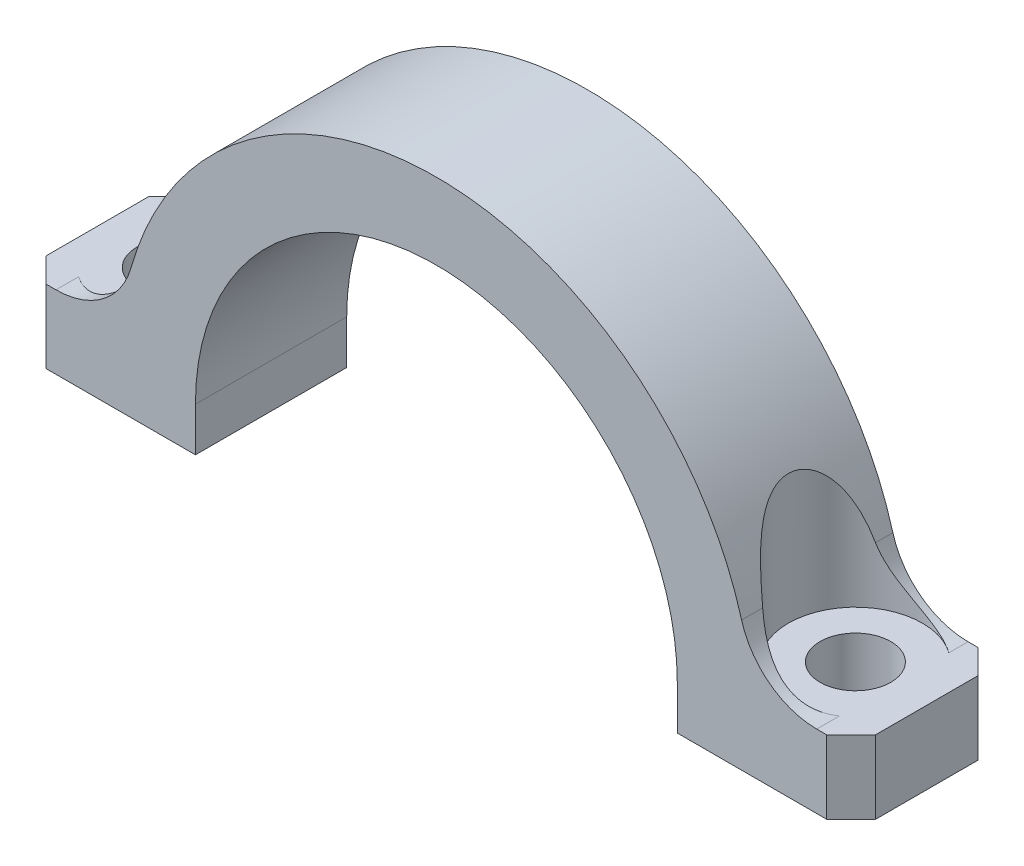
ISO-10303-21;
HEADER;
FILE_DESCRIPTION(('STEP AP214'),'2;1');
FILE_NAME('part.step','',(''),(''),'','','');
FILE_SCHEMA(('AUTOMOTIVE_DESIGN { 1 0 10303 214 1 1 1 1 }'));
ENDSEC;
DATA;
#1=APPLICATION_CONTEXT('core data for automotive mechanical design processes');
#2=APPLICATION_PROTOCOL_DEFINITION('international standard','automotive_design',2000,#1);
#3=PRODUCT_CONTEXT('',#1,'mechanical');
#4=PRODUCT('Part','Part','',(#3));
#5=PRODUCT_RELATED_PRODUCT_CATEGORY('part','',(#4));
#6=PRODUCT_DEFINITION_FORMATION('','',#4);
#7=PRODUCT_DEFINITION_CONTEXT('part definition',#1,'design');
#8=PRODUCT_DEFINITION('design','',#6,#7);
#9=PRODUCT_DEFINITION_SHAPE('','',#8);
#10=(LENGTH_UNIT() NAMED_UNIT(*) SI_UNIT(.MILLI.,.METRE.));
#11=(NAMED_UNIT(*) PLANE_ANGLE_UNIT() SI_UNIT($,.RADIAN.));
#12=(NAMED_UNIT(*) SI_UNIT($,.STERADIAN.) SOLID_ANGLE_UNIT());
#13=UNCERTAINTY_MEASURE_WITH_UNIT(LENGTH_MEASURE(1.E-05),#10,'distance_accuracy_value','');
#14=(GEOMETRIC_REPRESENTATION_CONTEXT(3) GLOBAL_UNCERTAINTY_ASSIGNED_CONTEXT((#13)) GLOBAL_UNIT_ASSIGNED_CONTEXT((#10,
#11,#12)) REPRESENTATION_CONTEXT('',''));
#15=CARTESIAN_POINT('',(0.,0.,0.));
#16=DIRECTION('',(0.,0.,1.));
#17=DIRECTION('',(1.,0.,0.));
#18=AXIS2_PLACEMENT_3D('',#15,#16,#17);
#19=CARTESIAN_POINT('',(28.,31.6,6.05));
#20=DIRECTION('',(0.,-1.,0.));
#21=DIRECTION('',(0.,0.,-1.));
#22=AXIS2_PLACEMENT_3D('',#19,#20,#21);
#23=CYLINDRICAL_SURFACE('',#22,5.5);
#24=CARTESIAN_POINT('',(25.0226295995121,12.6617283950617,10.674420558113));
#25=CARTESIAN_POINT('',(24.9809340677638,12.8094799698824,10.6475663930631));
#26=CARTESIAN_POINT('',(24.9379992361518,12.956602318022,10.6191342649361));
#27=CARTESIAN_POINT('',(24.8497396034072,13.2494318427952,10.558740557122));
#28=CARTESIAN_POINT('',(24.8044143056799,13.3951387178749,10.526778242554));
#29=CARTESIAN_POINT('',(24.7112978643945,13.6854862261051,10.4588287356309));
#30=CARTESIAN_POINT('',(24.6634977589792,13.8301204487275,10.4228262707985));
#31=CARTESIAN_POINT('',(24.5657416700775,14.1174759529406,10.3464759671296));
#32=CARTESIAN_POINT('',(24.5157858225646,14.2601973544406,10.3061284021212));
#33=CARTESIAN_POINT('',(24.3616637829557,14.6885620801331,10.1768314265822));
#34=CARTESIAN_POINT('',(24.254356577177,14.9709408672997,10.0804126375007));
#35=CARTESIAN_POINT('',(24.0888323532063,15.3852093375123,9.91764734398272));
#36=CARTESIAN_POINT('',(24.0329376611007,15.5216568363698,9.86041567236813));
#37=CARTESIAN_POINT('',(23.9199644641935,15.7910052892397,9.73919870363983));
#38=CARTESIAN_POINT('',(23.8628862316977,15.9239070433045,9.67521494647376));
#39=CARTESIAN_POINT('',(23.7560765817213,16.1671144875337,9.54927615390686));
#40=CARTESIAN_POINT('',(23.7064409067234,16.2779693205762,9.48830139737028));
#41=CARTESIAN_POINT('',(23.6069914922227,16.4960686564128,9.36029425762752));
#42=CARTESIAN_POINT('',(23.5571777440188,16.6033129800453,9.2932615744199));
#43=CARTESIAN_POINT('',(23.4578585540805,16.8134906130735,9.15263688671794));
#44=CARTESIAN_POINT('',(23.4083529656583,16.9164261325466,9.07904830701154));
#45=CARTESIAN_POINT('',(23.3101989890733,17.1172530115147,8.92474049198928));
#46=CARTESIAN_POINT('',(23.2615505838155,17.2151444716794,8.8440213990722));
#47=CARTESIAN_POINT('',(23.1651038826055,17.4063362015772,8.67364017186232));
#48=CARTESIAN_POINT('',(23.1173287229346,17.4995474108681,8.58386365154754));
#49=CARTESIAN_POINT('',(23.0243285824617,17.6785146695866,8.39600103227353));
#50=CARTESIAN_POINT('',(22.9791040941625,17.764269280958,8.29791333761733));
#51=CARTESIAN_POINT('',(22.8491521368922,18.0076448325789,7.9910750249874));
#52=CARTESIAN_POINT('',(22.7696690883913,18.152310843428,7.76895036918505));
#53=CARTESIAN_POINT('',(22.6622247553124,18.344834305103,7.38461369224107));
#54=CARTESIAN_POINT('',(22.6262281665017,18.4084909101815,7.2324775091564));
#55=CARTESIAN_POINT('',(22.5666158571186,18.5132284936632,6.91822476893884));
#56=CARTESIAN_POINT('',(22.5429912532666,18.5543256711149,6.75611546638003));
#57=CARTESIAN_POINT('',(22.5102696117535,18.6111068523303,6.42504264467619));
#58=CARTESIAN_POINT('',(22.5012548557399,18.6266469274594,6.25604576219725));
#59=CARTESIAN_POINT('',(22.498991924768,18.6305553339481,5.91763677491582));
#60=CARTESIAN_POINT('',(22.5057413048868,18.6189278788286,5.74822473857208));
#61=CARTESIAN_POINT('',(22.5331424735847,18.5714349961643,5.42760603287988));
#62=CARTESIAN_POINT('',(22.552678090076,18.537514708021,5.27600500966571));
#63=CARTESIAN_POINT('',(22.6028610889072,18.4496387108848,4.98071814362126));
#64=CARTESIAN_POINT('',(22.6335129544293,18.395674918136,4.83703552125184));
#65=CARTESIAN_POINT('',(22.717099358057,18.2468614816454,4.50734141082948));
#66=CARTESIAN_POINT('',(22.7740770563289,18.1442675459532,4.32586171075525));
#67=CARTESIAN_POINT('',(22.8994734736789,17.9138655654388,3.98409316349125));
#68=CARTESIAN_POINT('',(22.9679151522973,17.7860068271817,3.82384802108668));
#69=CARTESIAN_POINT('',(23.0940701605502,17.5447799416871,3.5604867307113));
#70=CARTESIAN_POINT('',(23.1503651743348,17.4354064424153,3.45293576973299));
#71=CARTESIAN_POINT('',(23.2652938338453,17.207856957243,3.24887863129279));
#72=CARTESIAN_POINT('',(23.3239287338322,17.0896762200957,3.15237848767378));
#73=CARTESIAN_POINT('',(23.4423806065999,16.846029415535,2.96941468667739));
#74=CARTESIAN_POINT('',(23.502199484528,16.7205508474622,2.88296905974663));
#75=CARTESIAN_POINT('',(23.6220027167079,16.4637518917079,2.71932261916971));
#76=CARTESIAN_POINT('',(23.6819871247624,16.3324293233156,2.64212529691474));
#77=CARTESIAN_POINT('',(23.8487775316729,15.9587954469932,2.43806375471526));
#78=CARTESIAN_POINT('',(23.9549469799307,15.7111426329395,2.32042681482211));
#79=CARTESIAN_POINT('',(24.1625251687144,15.2045585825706,2.10717104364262));
#80=CARTESIAN_POINT('',(24.2639295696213,14.945617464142,2.01157198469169));
#81=CARTESIAN_POINT('',(24.4601438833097,14.4193121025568,1.83852541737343));
#82=CARTESIAN_POINT('',(24.5549522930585,14.1519459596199,1.76108203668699));
#83=CARTESIAN_POINT('',(24.73674959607,13.6109078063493,1.62119254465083));
#84=CARTESIAN_POINT('',(24.823742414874,13.3372390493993,1.55873887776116));
#85=CARTESIAN_POINT('',(24.9263375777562,12.9947616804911,1.48895078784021));
#86=CARTESIAN_POINT('',(24.9459623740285,12.9282862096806,1.47579063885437));
#87=CARTESIAN_POINT('',(24.9846844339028,12.7951606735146,1.45017252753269));
#88=CARTESIAN_POINT('',(25.003782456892,12.7285110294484,1.43771352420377));
#89=CARTESIAN_POINT('',(25.0226295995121,12.6617283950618,1.4255794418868));
#90=B_SPLINE_CURVE_WITH_KNOTS('',3,(#24,#25,#26,#27,#28,#29,#30,#31,#32,#33,#34,#35,#36,#37,#38,
#39,#40,#41,#42,#43,#44,#45,#46,#47,#48,#49,#50,#51,#52,#53,#54,#55,#56,#57,#58,#59,#60,#61,#62,
#63,#64,#65,#66,#67,#68,#69,#70,#71,#72,#73,#74,#75,#76,#77,#78,#79,#80,#81,#82,#83,#84,#85,#86,
#87,#88,#89),.UNSPECIFIED.,.F.,.F.,(4,2,2,2,2,2,2,2,2,2,2,2,2,2,2,2,2,2,2,2,2,2,2,2,2,2,2,2,2,2,
2,2,4),(0.,0.467554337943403,0.93520619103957,1.40468951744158,1.87414327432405,
2.82419931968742,3.29856533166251,3.77282338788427,4.18038106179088,4.58795892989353,
4.99532511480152,5.40268316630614,5.81605208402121,6.22950054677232,7.05249297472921,
7.55702671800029,8.06119769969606,8.56819839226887,9.07512045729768,9.54281720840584,
10.0107027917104,10.6554643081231,11.3015329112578,11.7910696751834,12.2808724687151,
12.7715404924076,13.2623931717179,14.142948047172,15.0242899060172,15.9058319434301,
16.7869287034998,16.9985765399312,17.2099013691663),.UNSPECIFIED.);
#91=CARTESIAN_POINT('',(25.0226295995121,12.6617283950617,10.674420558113));
#92=VERTEX_POINT('',#91);
#93=CARTESIAN_POINT('',(25.0226295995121,12.6617283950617,1.42557944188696));
#94=VERTEX_POINT('',#93);
#95=EDGE_CURVE('E330',#92,#94,#90,.T.);
#96=ORIENTED_EDGE('',*,*,#95,.F.);
#97=CARTESIAN_POINT('',(25.0226295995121,12.6617283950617,10.674420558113));
#98=CARTESIAN_POINT('',(25.0721809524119,12.4861693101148,10.7063042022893));
#99=CARTESIAN_POINT('',(25.1290289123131,12.3134242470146,10.7418017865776));
#100=CARTESIAN_POINT('',(25.2567473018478,11.9743761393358,10.8176110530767));
#101=CARTESIAN_POINT('',(25.327610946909,11.8080700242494,10.8579204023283));
#102=CARTESIAN_POINT('',(25.4835636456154,11.4810228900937,10.9413626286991));
#103=CARTESIAN_POINT('',(25.5687793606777,11.3203483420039,10.9845183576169));
#104=CARTESIAN_POINT('',(25.7525601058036,11.0068152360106,11.0708889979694));
#105=CARTESIAN_POINT('',(25.8511264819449,10.853957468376,11.1141039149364));
#106=CARTESIAN_POINT('',(26.0613145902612,10.5566590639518,11.1982347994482));
#107=CARTESIAN_POINT('',(26.1729445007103,10.4122237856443,11.2391493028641));
#108=CARTESIAN_POINT('',(26.4088665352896,10.1326581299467,11.3162791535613));
#109=CARTESIAN_POINT('',(26.5331609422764,9.99752943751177,11.3524936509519));
#110=CARTESIAN_POINT('',(26.7930682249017,9.73841890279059,11.4176024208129));
#111=CARTESIAN_POINT('',(26.9286060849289,9.61437309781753,11.4465407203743));
#112=CARTESIAN_POINT('',(27.210797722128,9.37774739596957,11.4949620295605));
#113=CARTESIAN_POINT('',(27.3574405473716,9.26515645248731,11.5144542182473));
#114=CARTESIAN_POINT('',(27.5882533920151,9.10339410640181,11.5351438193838));
#115=CARTESIAN_POINT('',(27.6688436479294,9.04959712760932,11.540632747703));
#116=CARTESIAN_POINT('',(27.8325850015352,8.94559613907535,11.5480626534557));
#117=CARTESIAN_POINT('',(27.9157384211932,8.89539553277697,11.5500003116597));
#118=CARTESIAN_POINT('',(28.1085199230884,8.78492438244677,11.5499995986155));
#119=CARTESIAN_POINT('',(28.2188779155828,8.7259155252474,11.5467847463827));
#120=CARTESIAN_POINT('',(28.4425585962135,8.61460291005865,11.5333109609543));
#121=CARTESIAN_POINT('',(28.5558822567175,8.56230138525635,11.5230496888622));
#122=CARTESIAN_POINT('',(28.7846666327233,8.4646780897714,11.4949596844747));
#123=CARTESIAN_POINT('',(28.9001285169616,8.41936027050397,11.4771266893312));
#124=CARTESIAN_POINT('',(29.1321967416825,8.33589835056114,11.4335002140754));
#125=CARTESIAN_POINT('',(29.2488035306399,8.29775718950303,11.4077034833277));
#126=CARTESIAN_POINT('',(29.4822760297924,8.22864435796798,11.3478680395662));
#127=CARTESIAN_POINT('',(29.599141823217,8.19768593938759,11.313814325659));
#128=CARTESIAN_POINT('',(29.8317833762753,8.14291876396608,11.2374416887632));
#129=CARTESIAN_POINT('',(29.9475595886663,8.11910689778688,11.1951263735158));
#130=CARTESIAN_POINT('',(30.1769778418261,8.07833803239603,11.1023336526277));
#131=CARTESIAN_POINT('',(30.2906205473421,8.06137886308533,11.051858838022));
#132=CARTESIAN_POINT('',(30.5147917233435,8.03387726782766,10.9429889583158));
#133=CARTESIAN_POINT('',(30.6253214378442,8.02333224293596,10.884597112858));
#134=CARTESIAN_POINT('',(30.8108109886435,8.01030999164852,10.7783410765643));
#135=CARTESIAN_POINT('',(30.8867594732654,8.00637783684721,10.7323599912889));
#136=CARTESIAN_POINT('',(31.0362313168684,8.00122483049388,10.6368460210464));
#137=CARTESIAN_POINT('',(31.109760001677,7.99999756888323,10.587321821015));
#138=CARTESIAN_POINT('',(31.1820461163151,7.99999999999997,10.5360430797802));
#139=B_SPLINE_CURVE_WITH_KNOTS('',3,(#97,#98,#99,#100,#101,#102,#103,#104,#105,#106,#107,#108,
#109,#110,#111,#112,#113,#114,#115,#116,#117,#118,#119,#120,#121,#122,#123,#124,#125,#126,#127,
#128,#129,#130,#131,#132,#133,#134,#135,#136,#137,#138),.UNSPECIFIED.,.F.,.F.,(4,2,2,2,2,2,2,2,
2,2,2,2,2,2,2,2,2,2,2,2,4),(0.,0.555219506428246,1.11017090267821,1.67030459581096,
2.23049480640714,2.79103761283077,3.35168164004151,3.90884691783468,4.46546969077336,
4.75648424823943,5.04777066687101,5.42291649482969,5.79818690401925,6.17366886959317,
6.54930430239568,6.92562735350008,7.30178643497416,7.67782630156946,8.05371369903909,
8.32018625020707,8.58602663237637),.UNSPECIFIED.);
#140=CARTESIAN_POINT('',(31.1820461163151,7.99999999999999,10.5360430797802));
#141=VERTEX_POINT('',#140);
#142=EDGE_CURVE('E223',#92,#141,#139,.T.);
#143=ORIENTED_EDGE('',*,*,#142,.T.);
#144=CARTESIAN_POINT('',(28.,8.00000000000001,6.05));
#145=DIRECTION('',(0.,-1.,0.));
#146=DIRECTION('',(0.,0.,-1.));
#147=AXIS2_PLACEMENT_3D('',#144,#145,#146);
#148=CIRCLE('',#147,5.5);
#149=CARTESIAN_POINT('',(31.1820461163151,7.99999999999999,1.56395692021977));
#150=VERTEX_POINT('',#149);
#151=EDGE_CURVE('E241',#141,#150,#148,.T.);
#152=ORIENTED_EDGE('',*,*,#151,.T.);
#153=CARTESIAN_POINT('',(31.1820461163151,7.99999999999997,1.56395692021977));
#154=CARTESIAN_POINT('',(31.080036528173,7.99998542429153,1.49157324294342));
#155=CARTESIAN_POINT('',(30.9755126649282,8.00243852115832,1.42268875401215));
#156=CARTESIAN_POINT('',(30.7621814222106,8.01289780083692,1.29227706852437));
#157=CARTESIAN_POINT('',(30.6533722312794,8.02090635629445,1.23075302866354));
#158=CARTESIAN_POINT('',(30.4322868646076,8.04309707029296,1.11547480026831));
#159=CARTESIAN_POINT('',(30.3200101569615,8.05728018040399,1.06172181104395));
#160=CARTESIAN_POINT('',(30.0929713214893,8.09229821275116,0.962287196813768));
#161=CARTESIAN_POINT('',(29.9782097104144,8.1131317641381,0.916603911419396));
#162=CARTESIAN_POINT('',(29.7468437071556,8.16187425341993,0.833324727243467));
#163=CARTESIAN_POINT('',(29.6302347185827,8.18980484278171,0.795754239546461));
#164=CARTESIAN_POINT('',(29.3966027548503,8.25290052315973,0.728885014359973));
#165=CARTESIAN_POINT('',(29.2795797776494,8.28806564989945,0.699586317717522));
#166=CARTESIAN_POINT('',(29.0464575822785,8.36557222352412,0.649155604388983));
#167=CARTESIAN_POINT('',(28.930356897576,8.4078977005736,0.628005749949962));
#168=CARTESIAN_POINT('',(28.6998730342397,8.49964470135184,0.593467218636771));
#169=CARTESIAN_POINT('',(28.5854891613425,8.5490632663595,0.580075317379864));
#170=CARTESIAN_POINT('',(28.3921722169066,8.63940494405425,0.563407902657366));
#171=CARTESIAN_POINT('',(28.3125896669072,8.67862808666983,0.55832401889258));
#172=CARTESIAN_POINT('',(28.1550349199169,8.76040059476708,0.55162014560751));
#173=CARTESIAN_POINT('',(28.0770623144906,8.80294910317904,0.549999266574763));
#174=CARTESIAN_POINT('',(27.8593562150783,8.92770776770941,0.550001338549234));
#175=CARTESIAN_POINT('',(27.7217444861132,9.0136771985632,0.555404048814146));
#176=CARTESIAN_POINT('',(27.4538447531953,9.1955048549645,0.575532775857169));
#177=CARTESIAN_POINT('',(27.3235629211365,9.2913712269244,0.590266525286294));
#178=CARTESIAN_POINT('',(27.0708883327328,9.49240079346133,0.627536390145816));
#179=CARTESIAN_POINT('',(26.9485228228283,9.59759341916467,0.650097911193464));
#180=CARTESIAN_POINT('',(26.7127157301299,9.81622855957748,0.701404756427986));
#181=CARTESIAN_POINT('',(26.5992785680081,9.92967510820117,0.730153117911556));
#182=CARTESIAN_POINT('',(26.3828132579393,10.1629676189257,0.791934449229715));
#183=CARTESIAN_POINT('',(26.2796978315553,10.2827439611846,0.82492491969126));
#184=CARTESIAN_POINT('',(26.0830010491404,10.5290064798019,0.893840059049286));
#185=CARTESIAN_POINT('',(25.9894189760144,10.6554921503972,0.929764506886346));
#186=CARTESIAN_POINT('',(25.7236176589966,11.0438454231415,1.03953870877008));
#187=CARTESIAN_POINT('',(25.5657847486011,11.3152138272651,1.1155637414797));
#188=CARTESIAN_POINT('',(25.3455162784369,11.767358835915,1.23205842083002));
#189=CARTESIAN_POINT('',(25.2700659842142,11.9414050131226,1.27467616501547));
#190=CARTESIAN_POINT('',(25.1346307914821,12.2964835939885,1.35470707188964));
#191=CARTESIAN_POINT('',(25.0746408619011,12.4775137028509,1.3921219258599));
#192=CARTESIAN_POINT('',(25.0226295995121,12.6617283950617,1.42557944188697));
#193=B_SPLINE_CURVE_WITH_KNOTS('',3,(#153,#154,#155,#156,#157,#158,#159,#160,#161,#162,#163,
#164,#165,#166,#167,#168,#169,#170,#171,#172,#173,#174,#175,#176,#177,#178,#179,#180,#181,#182,
#183,#184,#185,#186,#187,#188,#189,#190,#191,#192),.UNSPECIFIED.,.F.,.F.,(4,2,2,2,2,2,2,2,2,2,2,
2,2,2,2,2,2,2,2,4),(0.,0.375185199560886,0.750530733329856,1.12593413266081,1.50126020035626,
1.87774534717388,2.25423235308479,2.62989048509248,3.00539237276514,3.27185826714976,
3.53825570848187,4.02444853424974,4.51104479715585,4.99923535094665,5.4876661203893,
5.97153765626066,6.45537276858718,7.42054162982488,8.00311680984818,8.58550216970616),.UNSPECIFIED.);
#194=EDGE_CURVE('E361',#150,#94,#193,.T.);
#195=ORIENTED_EDGE('',*,*,#194,.T.);
#196=EDGE_LOOP('',(#96,#143,#152,#195));
#197=FACE_BOUND('',#196,.T.);
#198=ADVANCED_FACE('F17',(#197),#23,.F.);
#199=CARTESIAN_POINT('',(-28.,31.6,6.05));
#200=DIRECTION('',(0.,-1.,0.));
#201=DIRECTION('',(0.,0.,-1.));
#202=AXIS2_PLACEMENT_3D('',#199,#200,#201);
#203=CYLINDRICAL_SURFACE('',#202,5.5);
#204=CARTESIAN_POINT('',(-31.1820461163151,7.99999999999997,10.5360430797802));
#205=CARTESIAN_POINT('',(-31.080036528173,7.99998542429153,10.6084267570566));
#206=CARTESIAN_POINT('',(-30.9755126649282,8.00243852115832,10.6773112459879));
#207=CARTESIAN_POINT('',(-30.7621814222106,8.01289780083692,10.8077229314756));
#208=CARTESIAN_POINT('',(-30.6533722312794,8.02090635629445,10.8692469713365));
#209=CARTESIAN_POINT('',(-30.4322868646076,8.04309707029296,10.9845251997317));
#210=CARTESIAN_POINT('',(-30.3200101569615,8.05728018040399,11.0382781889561));
#211=CARTESIAN_POINT('',(-30.0929713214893,8.09229821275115,11.1377128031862));
#212=CARTESIAN_POINT('',(-29.9782097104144,8.1131317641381,11.1833960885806));
#213=CARTESIAN_POINT('',(-29.7468437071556,8.16187425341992,11.2666752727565));
#214=CARTESIAN_POINT('',(-29.6302347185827,8.1898048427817,11.3042457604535));
#215=CARTESIAN_POINT('',(-29.3966027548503,8.25290052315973,11.37111498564));
#216=CARTESIAN_POINT('',(-29.2795797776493,8.28806564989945,11.4004136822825));
#217=CARTESIAN_POINT('',(-29.0464575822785,8.36557222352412,11.450844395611));
#218=CARTESIAN_POINT('',(-28.930356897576,8.4078977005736,11.47199425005));
#219=CARTESIAN_POINT('',(-28.6998730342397,8.49964470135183,11.5065327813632));
#220=CARTESIAN_POINT('',(-28.5854891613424,8.5490632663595,11.5199246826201));
#221=CARTESIAN_POINT('',(-28.3921722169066,8.63940494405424,11.5365920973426));
#222=CARTESIAN_POINT('',(-28.3125896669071,8.67862808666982,11.5416759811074));
#223=CARTESIAN_POINT('',(-28.1550349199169,8.76040059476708,11.5483798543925));
#224=CARTESIAN_POINT('',(-28.0770623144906,8.80294910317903,11.5500007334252));
#225=CARTESIAN_POINT('',(-27.8593562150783,8.9277077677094,11.5499986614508));
#226=CARTESIAN_POINT('',(-27.7217444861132,9.01367719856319,11.5445959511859));
#227=CARTESIAN_POINT('',(-27.4538447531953,9.19550485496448,11.5244672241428));
#228=CARTESIAN_POINT('',(-27.3235629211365,9.29137122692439,11.5097334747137));
#229=CARTESIAN_POINT('',(-27.0708883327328,9.49240079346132,11.4724636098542));
#230=CARTESIAN_POINT('',(-26.9485228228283,9.59759341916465,11.4499020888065));
#231=CARTESIAN_POINT('',(-26.7127157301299,9.81622855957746,11.398595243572));
#232=CARTESIAN_POINT('',(-26.5992785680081,9.92967510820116,11.3698468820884));
#233=CARTESIAN_POINT('',(-26.3828132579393,10.1629676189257,11.3080655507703));
#234=CARTESIAN_POINT('',(-26.2796978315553,10.2827439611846,11.2750750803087));
#235=CARTESIAN_POINT('',(-26.0830010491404,10.5290064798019,11.2061599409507));
#236=CARTESIAN_POINT('',(-25.9894189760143,10.6554921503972,11.1702354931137));
#237=CARTESIAN_POINT('',(-25.7236176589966,11.0438454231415,11.0604612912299));
#238=CARTESIAN_POINT('',(-25.5657847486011,11.3152138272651,10.9844362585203));
#239=CARTESIAN_POINT('',(-25.3455162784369,11.767358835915,10.86794157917));
#240=CARTESIAN_POINT('',(-25.2700659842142,11.9414050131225,10.8253238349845));
#241=CARTESIAN_POINT('',(-25.1346307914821,12.2964835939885,10.7452929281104));
#242=CARTESIAN_POINT('',(-25.0746408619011,12.4775137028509,10.7078780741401));
#243=CARTESIAN_POINT('',(-25.0226295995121,12.6617283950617,10.674420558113));
#244=B_SPLINE_CURVE_WITH_KNOTS('',3,(#204,#205,#206,#207,#208,#209,#210,#211,#212,#213,#214,
#215,#216,#217,#218,#219,#220,#221,#222,#223,#224,#225,#226,#227,#228,#229,#230,#231,#232,#233,
#234,#235,#236,#237,#238,#239,#240,#241,#242,#243),.UNSPECIFIED.,.F.,.F.,(4,2,2,2,2,2,2,2,2,2,2,
2,2,2,2,2,2,2,2,4),(0.,0.375185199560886,0.75053073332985,1.12593413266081,1.50126020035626,
1.87774534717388,2.25423235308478,2.62989048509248,3.00539237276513,3.27185826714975,
3.53825570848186,4.02444853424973,4.51104479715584,4.99923535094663,5.48766612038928,
5.97153765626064,6.45537276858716,7.42054162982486,8.00311680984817,8.58550216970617),.UNSPECIFIED.);
#245=CARTESIAN_POINT('',(-31.1820461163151,7.99999999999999,10.5360430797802));
#246=VERTEX_POINT('',#245);
#247=CARTESIAN_POINT('',(-25.0226295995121,12.6617283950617,10.674420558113));
#248=VERTEX_POINT('',#247);
#249=EDGE_CURVE('E103',#246,#248,#244,.T.);
#250=ORIENTED_EDGE('',*,*,#249,.T.);
#251=CARTESIAN_POINT('',(-25.0226295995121,12.6617283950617,1.42557944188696));
#252=CARTESIAN_POINT('',(-24.9809340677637,12.8094799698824,1.45243360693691));
#253=CARTESIAN_POINT('',(-24.9379992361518,12.956602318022,1.48086573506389));
#254=CARTESIAN_POINT('',(-24.8497396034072,13.2494318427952,1.541259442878));
#255=CARTESIAN_POINT('',(-24.8044143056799,13.3951387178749,1.57322175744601));
#256=CARTESIAN_POINT('',(-24.7112978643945,13.6854862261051,1.64117126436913));
#257=CARTESIAN_POINT('',(-24.6634977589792,13.8301204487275,1.67717372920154));
#258=CARTESIAN_POINT('',(-24.5657416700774,14.1174759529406,1.75352403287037));
#259=CARTESIAN_POINT('',(-24.5157858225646,14.2601973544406,1.7938715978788));
#260=CARTESIAN_POINT('',(-24.3616637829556,14.6885620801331,1.92316857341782));
#261=CARTESIAN_POINT('',(-24.2543565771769,14.9709408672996,2.01958736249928));
#262=CARTESIAN_POINT('',(-24.0888323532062,15.3852093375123,2.18235265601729));
#263=CARTESIAN_POINT('',(-24.0329376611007,15.5216568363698,2.23958432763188));
#264=CARTESIAN_POINT('',(-23.9199644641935,15.7910052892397,2.36080129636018));
#265=CARTESIAN_POINT('',(-23.8628862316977,15.9239070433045,2.42478505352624));
#266=CARTESIAN_POINT('',(-23.7560765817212,16.1671144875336,2.55072384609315));
#267=CARTESIAN_POINT('',(-23.7064409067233,16.2779693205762,2.61169860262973));
#268=CARTESIAN_POINT('',(-23.6069914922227,16.4960686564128,2.73970574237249));
#269=CARTESIAN_POINT('',(-23.5571777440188,16.6033129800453,2.80673842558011));
#270=CARTESIAN_POINT('',(-23.4578585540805,16.8134906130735,2.94736311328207));
#271=CARTESIAN_POINT('',(-23.4083529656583,16.9164261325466,3.02095169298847));
#272=CARTESIAN_POINT('',(-23.3101989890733,17.1172530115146,3.17525950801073));
#273=CARTESIAN_POINT('',(-23.2615505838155,17.2151444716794,3.2559786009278));
#274=CARTESIAN_POINT('',(-23.1651038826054,17.4063362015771,3.42635982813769));
#275=CARTESIAN_POINT('',(-23.1173287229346,17.4995474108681,3.51613634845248));
#276=CARTESIAN_POINT('',(-23.0243285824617,17.6785146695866,3.70399896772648));
#277=CARTESIAN_POINT('',(-22.9791040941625,17.764269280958,3.80208666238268));
#278=CARTESIAN_POINT('',(-22.8491521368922,18.0076448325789,4.10892497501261));
#279=CARTESIAN_POINT('',(-22.7696690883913,18.1523108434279,4.33104963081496));
#280=CARTESIAN_POINT('',(-22.6622247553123,18.344834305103,4.71538630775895));
#281=CARTESIAN_POINT('',(-22.6262281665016,18.4084909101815,4.86752249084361));
#282=CARTESIAN_POINT('',(-22.5666158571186,18.5132284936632,5.18177523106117));
#283=CARTESIAN_POINT('',(-22.5429912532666,18.5543256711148,5.34388453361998));
#284=CARTESIAN_POINT('',(-22.5102696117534,18.6111068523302,5.67495735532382));
#285=CARTESIAN_POINT('',(-22.5012548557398,18.6266469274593,5.84395423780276));
#286=CARTESIAN_POINT('',(-22.498991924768,18.6305553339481,6.18236322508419));
#287=CARTESIAN_POINT('',(-22.5057413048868,18.6189278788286,6.35177526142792));
#288=CARTESIAN_POINT('',(-22.5331424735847,18.5714349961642,6.67239396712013));
#289=CARTESIAN_POINT('',(-22.552678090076,18.5375147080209,6.82399499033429));
#290=CARTESIAN_POINT('',(-22.6028610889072,18.4496387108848,7.11928185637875));
#291=CARTESIAN_POINT('',(-22.6335129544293,18.3956749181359,7.26296447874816));
#292=CARTESIAN_POINT('',(-22.717099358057,18.2468614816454,7.59265858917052));
#293=CARTESIAN_POINT('',(-22.7740770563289,18.1442675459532,7.77413828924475));
#294=CARTESIAN_POINT('',(-22.8994734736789,17.9138655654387,8.11590683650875));
#295=CARTESIAN_POINT('',(-22.9679151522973,17.7860068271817,8.27615197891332));
#296=CARTESIAN_POINT('',(-23.0940701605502,17.5447799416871,8.5395132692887));
#297=CARTESIAN_POINT('',(-23.1503651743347,17.4354064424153,8.64706423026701));
#298=CARTESIAN_POINT('',(-23.2652938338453,17.207856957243,8.85112136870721));
#299=CARTESIAN_POINT('',(-23.3239287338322,17.0896762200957,8.94762151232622));
#300=CARTESIAN_POINT('',(-23.4423806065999,16.846029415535,9.13058531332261));
#301=CARTESIAN_POINT('',(-23.502199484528,16.7205508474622,9.21703094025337));
#302=CARTESIAN_POINT('',(-23.6220027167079,16.4637518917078,9.3806773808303));
#303=CARTESIAN_POINT('',(-23.6819871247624,16.3324293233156,9.45787470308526));
#304=CARTESIAN_POINT('',(-23.8487775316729,15.9587954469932,9.66193624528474));
#305=CARTESIAN_POINT('',(-23.9549469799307,15.7111426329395,9.77957318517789));
#306=CARTESIAN_POINT('',(-24.1625251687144,15.2045585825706,9.99282895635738));
#307=CARTESIAN_POINT('',(-24.2639295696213,14.945617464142,10.0884280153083));
#308=CARTESIAN_POINT('',(-24.4601438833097,14.4193121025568,10.2614745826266));
#309=CARTESIAN_POINT('',(-24.5549522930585,14.1519459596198,10.338917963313));
#310=CARTESIAN_POINT('',(-24.73674959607,13.6109078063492,10.4788074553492));
#311=CARTESIAN_POINT('',(-24.823742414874,13.3372390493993,10.5412611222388));
#312=CARTESIAN_POINT('',(-24.9263375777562,12.9947616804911,10.6110492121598));
#313=CARTESIAN_POINT('',(-24.9459623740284,12.9282862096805,10.6242093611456));
#314=CARTESIAN_POINT('',(-24.9846844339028,12.7951606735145,10.6498274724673));
#315=CARTESIAN_POINT('',(-25.003782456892,12.7285110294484,10.6622864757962));
#316=CARTESIAN_POINT('',(-25.0226295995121,12.6617283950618,10.6744205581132));
#317=B_SPLINE_CURVE_WITH_KNOTS('',3,(#251,#252,#253,#254,#255,#256,#257,#258,#259,#260,#261,
#262,#263,#264,#265,#266,#267,#268,#269,#270,#271,#272,#273,#274,#275,#276,#277,#278,#279,#280,
#281,#282,#283,#284,#285,#286,#287,#288,#289,#290,#291,#292,#293,#294,#295,#296,#297,#298,#299,
#300,#301,#302,#303,#304,#305,#306,#307,#308,#309,#310,#311,#312,#313,#314,#315,#316),
.UNSPECIFIED.,.F.,.F.,(4,2,2,2,2,2,2,2,2,2,2,2,2,2,2,2,2,2,2,2,2,2,2,2,2,2,2,2,2,2,2,2,4),(0.,
0.4675543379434,0.935206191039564,1.40468951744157,1.87414327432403,2.82419931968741,
3.2985653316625,3.77282338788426,4.18038106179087,4.58795892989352,4.9953251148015,
5.40268316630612,5.81605208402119,6.2295005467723,7.0524929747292,7.55702671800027,
8.06119769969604,8.56819839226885,9.07512045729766,9.54281720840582,10.0107027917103,
10.655464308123,11.3015329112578,11.7910696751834,12.2808724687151,12.7715404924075,
13.2623931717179,14.142948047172,15.0242899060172,15.9058319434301,16.7869287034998,
16.9985765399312,17.2099013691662),.UNSPECIFIED.);
#318=CARTESIAN_POINT('',(-25.0226295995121,12.6617283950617,1.42557944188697));
#319=VERTEX_POINT('',#318);
#320=EDGE_CURVE('E355',#319,#248,#317,.T.);
#321=ORIENTED_EDGE('',*,*,#320,.F.);
#322=CARTESIAN_POINT('',(-25.0226295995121,12.6617283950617,1.42557944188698));
#323=CARTESIAN_POINT('',(-25.0721809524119,12.4861693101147,1.39369579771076));
#324=CARTESIAN_POINT('',(-25.1290289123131,12.3134242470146,1.35819821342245));
#325=CARTESIAN_POINT('',(-25.2567473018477,11.9743761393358,1.28238894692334));
#326=CARTESIAN_POINT('',(-25.327610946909,11.8080700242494,1.24207959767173));
#327=CARTESIAN_POINT('',(-25.4835636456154,11.4810228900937,1.15863737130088));
#328=CARTESIAN_POINT('',(-25.5687793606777,11.3203483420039,1.1154816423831));
#329=CARTESIAN_POINT('',(-25.7525601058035,11.0068152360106,1.02911100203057));
#330=CARTESIAN_POINT('',(-25.8511264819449,10.853957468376,0.985896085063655));
#331=CARTESIAN_POINT('',(-26.0613145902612,10.5566590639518,0.901765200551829));
#332=CARTESIAN_POINT('',(-26.1729445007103,10.4122237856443,0.860850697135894));
#333=CARTESIAN_POINT('',(-26.4088665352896,10.1326581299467,0.783720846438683));
#334=CARTESIAN_POINT('',(-26.5331609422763,9.99752943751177,0.747506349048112));
#335=CARTESIAN_POINT('',(-26.7930682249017,9.73841890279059,0.68239757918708));
#336=CARTESIAN_POINT('',(-26.9286060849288,9.61437309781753,0.653459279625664));
#337=CARTESIAN_POINT('',(-27.2107977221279,9.37774739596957,0.60503797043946));
#338=CARTESIAN_POINT('',(-27.3574405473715,9.26515645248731,0.585545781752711));
#339=CARTESIAN_POINT('',(-27.5882533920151,9.10339410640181,0.564856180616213));
#340=CARTESIAN_POINT('',(-27.6688436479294,9.04959712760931,0.559367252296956));
#341=CARTESIAN_POINT('',(-27.8325850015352,8.94559613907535,0.551937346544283));
#342=CARTESIAN_POINT('',(-27.9157384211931,8.89539553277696,0.549999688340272));
#343=CARTESIAN_POINT('',(-28.1085199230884,8.78492438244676,0.550000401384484));
#344=CARTESIAN_POINT('',(-28.2188779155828,8.72591552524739,0.553215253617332));
#345=CARTESIAN_POINT('',(-28.4425585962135,8.61460291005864,0.566689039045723));
#346=CARTESIAN_POINT('',(-28.5558822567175,8.56230138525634,0.576950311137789));
#347=CARTESIAN_POINT('',(-28.7846666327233,8.46467808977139,0.605040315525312));
#348=CARTESIAN_POINT('',(-28.9001285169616,8.41936027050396,0.622873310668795));
#349=CARTESIAN_POINT('',(-29.1321967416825,8.33589835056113,0.666499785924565));
#350=CARTESIAN_POINT('',(-29.2488035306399,8.29775718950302,0.692296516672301));
#351=CARTESIAN_POINT('',(-29.4822760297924,8.22864435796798,0.752131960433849));
#352=CARTESIAN_POINT('',(-29.599141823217,8.19768593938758,0.78618567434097));
#353=CARTESIAN_POINT('',(-29.8317833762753,8.14291876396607,0.862558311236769));
#354=CARTESIAN_POINT('',(-29.9475595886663,8.11910689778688,0.904873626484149));
#355=CARTESIAN_POINT('',(-30.1769778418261,8.07833803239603,0.997666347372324));
#356=CARTESIAN_POINT('',(-30.290620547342,8.06137886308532,1.048141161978));
#357=CARTESIAN_POINT('',(-30.5147917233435,8.03387726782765,1.15701104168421));
#358=CARTESIAN_POINT('',(-30.6253214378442,8.02333224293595,1.21540288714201));
#359=CARTESIAN_POINT('',(-30.8108109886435,8.01030999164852,1.32165892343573));
#360=CARTESIAN_POINT('',(-30.8867594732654,8.0063778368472,1.3676400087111));
#361=CARTESIAN_POINT('',(-31.0362313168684,8.00122483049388,1.46315397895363));
#362=CARTESIAN_POINT('',(-31.109760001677,7.99999756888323,1.512678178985));
#363=CARTESIAN_POINT('',(-31.1820461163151,7.99999999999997,1.56395692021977));
#364=B_SPLINE_CURVE_WITH_KNOTS('',3,(#322,#323,#324,#325,#326,#327,#328,#329,#330,#331,#332,
#333,#334,#335,#336,#337,#338,#339,#340,#341,#342,#343,#344,#345,#346,#347,#348,#349,#350,#351,
#352,#353,#354,#355,#356,#357,#358,#359,#360,#361,#362,#363),.UNSPECIFIED.,.F.,.F.,(4,2,2,2,2,2,
2,2,2,2,2,2,2,2,2,2,2,2,2,2,4),(0.,0.555219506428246,1.11017090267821,1.67030459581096,
2.23049480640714,2.79103761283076,3.35168164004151,3.90884691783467,4.46546969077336,
4.75648424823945,5.04777066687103,5.42291649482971,5.79818690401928,6.17366886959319,
6.5493043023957,6.9256273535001,7.30178643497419,7.67782630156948,8.05371369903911,
8.32018625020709,8.58602663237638),.UNSPECIFIED.);
#365=CARTESIAN_POINT('',(-31.1820461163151,7.99999999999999,1.56395692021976));
#366=VERTEX_POINT('',#365);
#367=EDGE_CURVE('E259',#319,#366,#364,.T.);
#368=ORIENTED_EDGE('',*,*,#367,.T.);
#369=CARTESIAN_POINT('',(-28.,8.00000000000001,6.05));
#370=DIRECTION('',(0.,-1.,0.));
#371=DIRECTION('',(0.,0.,-1.));
#372=AXIS2_PLACEMENT_3D('',#369,#370,#371);
#373=CIRCLE('',#372,5.5);
#374=EDGE_CURVE('E21',#366,#246,#373,.T.);
#375=ORIENTED_EDGE('',*,*,#374,.T.);
#376=EDGE_LOOP('',(#250,#321,#368,#375));
#377=FACE_BOUND('',#376,.T.);
#378=ADVANCED_FACE('F336',(#377),#203,.F.);
#379=CARTESIAN_POINT('',(-34.,8.00000000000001,12.4));
#380=DIRECTION('',(0.,-1.,0.));
#381=DIRECTION('',(1.,0.,0.));
#382=AXIS2_PLACEMENT_3D('',#379,#380,#381);
#383=PLANE('',#382);
#384=ORIENTED_EDGE('',*,*,#374,.F.);
#385=DIRECTION('',(0.,0.,-1.));
#386=VECTOR('',#385,1.);
#387=CARTESIAN_POINT('',(-31.1820461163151,7.99999999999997,12.4));
#388=LINE('',#387,#386);
#389=CARTESIAN_POINT('',(-31.1820461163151,7.99999999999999,0.));
#390=VERTEX_POINT('',#389);
#391=EDGE_CURVE('E504',#366,#390,#388,.T.);
#392=ORIENTED_EDGE('',*,*,#391,.T.);
#393=DIRECTION('',(1.,0.,0.));
#394=VECTOR('',#393,1.);
#395=CARTESIAN_POINT('',(-34.,8.00000000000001,0.));
#396=LINE('',#395,#394);
#397=CARTESIAN_POINT('',(-32.,8.00000000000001,0.));
#398=VERTEX_POINT('',#397);
#399=EDGE_CURVE('E123',#398,#390,#396,.T.);
#400=ORIENTED_EDGE('',*,*,#399,.F.);
#401=DIRECTION('',(0.707106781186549,0.,-0.707106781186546));
#402=VECTOR('',#401,1.);
#403=CARTESIAN_POINT('',(-34.,8.00000000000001,2.));
#404=LINE('',#403,#402);
#405=CARTESIAN_POINT('',(-34.,8.00000000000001,2.00000000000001));
#406=VERTEX_POINT('',#405);
#407=EDGE_CURVE('E258',#398,#406,#404,.F.);
#408=ORIENTED_EDGE('',*,*,#407,.T.);
#409=DIRECTION('',(0.,0.,-1.));
#410=VECTOR('',#409,1.);
#411=CARTESIAN_POINT('',(-34.,8.00000000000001,12.4));
#412=LINE('',#411,#410);
#413=CARTESIAN_POINT('',(-34.,8.00000000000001,10.4));
#414=VERTEX_POINT('',#413);
#415=EDGE_CURVE('E198',#406,#414,#412,.F.);
#416=ORIENTED_EDGE('',*,*,#415,.T.);
#417=DIRECTION('',(0.707106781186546,0.,0.707106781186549));
#418=VECTOR('',#417,1.);
#419=CARTESIAN_POINT('',(-32.,8.00000000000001,12.4));
#420=LINE('',#419,#418);
#421=CARTESIAN_POINT('',(-32.,8.00000000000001,12.4));
#422=VERTEX_POINT('',#421);
#423=EDGE_CURVE('E111',#422,#414,#420,.F.);
#424=ORIENTED_EDGE('',*,*,#423,.F.);
#425=DIRECTION('',(1.,0.,0.));
#426=VECTOR('',#425,1.);
#427=CARTESIAN_POINT('',(-34.,8.00000000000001,12.4));
#428=LINE('',#427,#426);
#429=CARTESIAN_POINT('',(-31.1820461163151,7.99999999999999,12.4));
#430=VERTEX_POINT('',#429);
#431=EDGE_CURVE('E187',#430,#422,#428,.F.);
#432=ORIENTED_EDGE('',*,*,#431,.F.);
#433=DIRECTION('',(0.,0.,-1.));
#434=VECTOR('',#433,1.);
#435=CARTESIAN_POINT('',(-31.1820461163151,7.99999999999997,12.4));
#436=LINE('',#435,#434);
#437=EDGE_CURVE('E218',#430,#246,#436,.T.);
#438=ORIENTED_EDGE('',*,*,#437,.T.);
#439=EDGE_LOOP('',(#384,#392,#400,#408,#416,#424,#432,#438));
#440=FACE_BOUND('',#439,.T.);
#441=CARTESIAN_POINT('',(-28.,8.00000000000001,6.05));
#442=DIRECTION('',(0.,1.,0.));
#443=DIRECTION('',(0.,0.,1.));
#444=AXIS2_PLACEMENT_3D('',#441,#442,#443);
#445=CIRCLE('',#444,2.9);
#446=CARTESIAN_POINT('',(-28.,8.00000000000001,8.95));
#447=VERTEX_POINT('',#446);
#448=EDGE_CURVE('E267',#447,#447,#445,.F.);
#449=ORIENTED_EDGE('',*,*,#448,.T.);
#450=EDGE_LOOP('',(#449));
#451=FACE_BOUND('',#450,.T.);
#452=ADVANCED_FACE('F196',(#440,#451),#383,.F.);
#453=CARTESIAN_POINT('',(-28.,8.00000000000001,6.05));
#454=DIRECTION('',(0.,1.,0.));
#455=DIRECTION('',(0.,0.,1.));
#456=AXIS2_PLACEMENT_3D('',#453,#454,#455);
#457=CYLINDRICAL_SURFACE('',#456,2.9);
#458=CARTESIAN_POINT('',(-28.,2.,6.05));
#459=DIRECTION('',(0.,1.,0.));
#460=DIRECTION('',(0.,0.,1.));
#461=AXIS2_PLACEMENT_3D('',#458,#459,#460);
#462=CIRCLE('',#461,2.9);
#463=CARTESIAN_POINT('',(-28.,2.,8.95));
#464=VERTEX_POINT('',#463);
#465=EDGE_CURVE('E320',#464,#464,#462,.F.);
#466=ORIENTED_EDGE('',*,*,#465,.T.);
#467=EDGE_LOOP('',(#466));
#468=FACE_BOUND('',#467,.T.);
#469=ORIENTED_EDGE('',*,*,#448,.F.);
#470=EDGE_LOOP('',(#469));
#471=FACE_BOUND('',#470,.T.);
#472=ADVANCED_FACE('F402',(#468,#471),#457,.F.);
#473=CARTESIAN_POINT('',(-34.,2.,12.4));
#474=DIRECTION('',(1.,0.,0.));
#475=DIRECTION('',(0.,0.,-1.));
#476=AXIS2_PLACEMENT_3D('',#473,#474,#475);
#477=PLANE('',#476);
#478=DIRECTION('',(0.,1.,0.));
#479=VECTOR('',#478,1.);
#480=CARTESIAN_POINT('',(-34.,5.60000000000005,10.4));
#481=LINE('',#480,#479);
#482=CARTESIAN_POINT('',(-34.,2.,10.4));
#483=VERTEX_POINT('',#482);
#484=EDGE_CURVE('E200',#414,#483,#481,.F.);
#485=ORIENTED_EDGE('',*,*,#484,.F.);
#486=ORIENTED_EDGE('',*,*,#415,.F.);
#487=DIRECTION('',(0.,1.,0.));
#488=VECTOR('',#487,1.);
#489=CARTESIAN_POINT('',(-34.,2.,2.00000000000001));
#490=LINE('',#489,#488);
#491=CARTESIAN_POINT('',(-34.,2.,2.00000000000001));
#492=VERTEX_POINT('',#491);
#493=EDGE_CURVE('E256',#406,#492,#490,.F.);
#494=ORIENTED_EDGE('',*,*,#493,.T.);
#495=DIRECTION('',(0.,0.,1.));
#496=VECTOR('',#495,1.);
#497=CARTESIAN_POINT('',(-34.,2.,12.4));
#498=LINE('',#497,#496);
#499=EDGE_CURVE('E251',#492,#483,#498,.T.);
#500=ORIENTED_EDGE('',*,*,#499,.T.);
#501=EDGE_LOOP('',(#485,#486,#494,#500));
#502=FACE_BOUND('',#501,.T.);
#503=ADVANCED_FACE('F398',(#502),#477,.F.);
#504=CARTESIAN_POINT('',(28.,8.00000000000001,6.05));
#505=DIRECTION('',(0.,1.,0.));
#506=DIRECTION('',(0.,0.,1.));
#507=AXIS2_PLACEMENT_3D('',#504,#505,#506);
#508=CYLINDRICAL_SURFACE('',#507,2.9);
#509=CARTESIAN_POINT('',(28.,2.,6.05));
#510=DIRECTION('',(0.,1.,0.));
#511=DIRECTION('',(0.,0.,1.));
#512=AXIS2_PLACEMENT_3D('',#509,#510,#511);
#513=CIRCLE('',#512,2.9);
#514=CARTESIAN_POINT('',(28.,2.,8.95));
#515=VERTEX_POINT('',#514);
#516=EDGE_CURVE('E228',#515,#515,#513,.F.);
#517=ORIENTED_EDGE('',*,*,#516,.T.);
#518=EDGE_LOOP('',(#517));
#519=FACE_BOUND('',#518,.T.);
#520=CARTESIAN_POINT('',(28.,8.00000000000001,6.05));
#521=DIRECTION('',(0.,1.,0.));
#522=DIRECTION('',(0.,0.,1.));
#523=AXIS2_PLACEMENT_3D('',#520,#521,#522);
#524=CIRCLE('',#523,2.9);
#525=CARTESIAN_POINT('',(28.,8.00000000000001,8.95));
#526=VERTEX_POINT('',#525);
#527=EDGE_CURVE('E266',#526,#526,#524,.T.);
#528=ORIENTED_EDGE('',*,*,#527,.T.);
#529=EDGE_LOOP('',(#528));
#530=FACE_BOUND('',#529,.T.);
#531=ADVANCED_FACE('F394',(#519,#530),#508,.F.);
#532=CARTESIAN_POINT('',(34.,2.,12.4));
#533=DIRECTION('',(-1.,0.,0.));
#534=DIRECTION('',(0.,0.,1.));
#535=AXIS2_PLACEMENT_3D('',#532,#533,#534);
#536=PLANE('',#535);
#537=DIRECTION('',(0.,1.,0.));
#538=VECTOR('',#537,1.);
#539=CARTESIAN_POINT('',(34.,5.60000000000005,10.4));
#540=LINE('',#539,#538);
#541=CARTESIAN_POINT('',(34.,2.,10.4));
#542=VERTEX_POINT('',#541);
#543=CARTESIAN_POINT('',(34.,8.00000000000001,10.4));
#544=VERTEX_POINT('',#543);
#545=EDGE_CURVE('E238',#542,#544,#540,.T.);
#546=ORIENTED_EDGE('',*,*,#545,.F.);
#547=DIRECTION('',(0.,0.,1.));
#548=VECTOR('',#547,1.);
#549=CARTESIAN_POINT('',(34.,2.,12.4));
#550=LINE('',#549,#548);
#551=CARTESIAN_POINT('',(34.,2.,2.00000000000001));
#552=VERTEX_POINT('',#551);
#553=EDGE_CURVE('E227',#542,#552,#550,.F.);
#554=ORIENTED_EDGE('',*,*,#553,.T.);
#555=DIRECTION('',(0.,1.,0.));
#556=VECTOR('',#555,1.);
#557=CARTESIAN_POINT('',(34.,2.,2.00000000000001));
#558=LINE('',#557,#556);
#559=CARTESIAN_POINT('',(34.,8.00000000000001,2.00000000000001));
#560=VERTEX_POINT('',#559);
#561=EDGE_CURVE('E167',#552,#560,#558,.T.);
#562=ORIENTED_EDGE('',*,*,#561,.T.);
#563=DIRECTION('',(0.,0.,-1.));
#564=VECTOR('',#563,1.);
#565=CARTESIAN_POINT('',(34.,8.00000000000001,12.4));
#566=LINE('',#565,#564);
#567=EDGE_CURVE('E159',#560,#544,#566,.F.);
#568=ORIENTED_EDGE('',*,*,#567,.T.);
#569=EDGE_LOOP('',(#546,#554,#562,#568));
#570=FACE_BOUND('',#569,.T.);
#571=ADVANCED_FACE('F391',(#570),#536,.F.);
#572=CARTESIAN_POINT('',(34.,8.00000000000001,12.4));
#573=DIRECTION('',(0.,-1.,0.));
#574=DIRECTION('',(0.,0.,-1.));
#575=AXIS2_PLACEMENT_3D('',#572,#573,#574);
#576=PLANE('',#575);
#577=ORIENTED_EDGE('',*,*,#151,.F.);
#578=DIRECTION('',(0.,0.,-1.));
#579=VECTOR('',#578,1.);
#580=CARTESIAN_POINT('',(31.1820461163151,7.99999999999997,12.4));
#581=LINE('',#580,#579);
#582=CARTESIAN_POINT('',(31.1820461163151,7.99999999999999,12.4));
#583=VERTEX_POINT('',#582);
#584=EDGE_CURVE('E220',#141,#583,#581,.F.);
#585=ORIENTED_EDGE('',*,*,#584,.T.);
#586=DIRECTION('',(1.,0.,0.));
#587=VECTOR('',#586,1.);
#588=CARTESIAN_POINT('',(34.,8.00000000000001,12.4));
#589=LINE('',#588,#587);
#590=CARTESIAN_POINT('',(32.,8.00000000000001,12.4));
#591=VERTEX_POINT('',#590);
#592=EDGE_CURVE('E277',#591,#583,#589,.F.);
#593=ORIENTED_EDGE('',*,*,#592,.F.);
#594=DIRECTION('',(0.707106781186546,0.,-0.707106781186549));
#595=VECTOR('',#594,1.);
#596=CARTESIAN_POINT('',(32.,8.00000000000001,12.4));
#597=LINE('',#596,#595);
#598=EDGE_CURVE('E240',#544,#591,#597,.F.);
#599=ORIENTED_EDGE('',*,*,#598,.F.);
#600=ORIENTED_EDGE('',*,*,#567,.F.);
#601=DIRECTION('',(0.707106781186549,0.,0.707106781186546));
#602=VECTOR('',#601,1.);
#603=CARTESIAN_POINT('',(34.,8.00000000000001,2.));
#604=LINE('',#603,#602);
#605=CARTESIAN_POINT('',(32.,8.00000000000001,0.));
#606=VERTEX_POINT('',#605);
#607=EDGE_CURVE('E288',#560,#606,#604,.F.);
#608=ORIENTED_EDGE('',*,*,#607,.T.);
#609=DIRECTION('',(1.,0.,0.));
#610=VECTOR('',#609,1.);
#611=CARTESIAN_POINT('',(34.,8.00000000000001,0.));
#612=LINE('',#611,#610);
#613=CARTESIAN_POINT('',(31.1820461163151,7.99999999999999,0.));
#614=VERTEX_POINT('',#613);
#615=EDGE_CURVE('E270',#614,#606,#612,.T.);
#616=ORIENTED_EDGE('',*,*,#615,.F.);
#617=DIRECTION('',(0.,0.,-1.));
#618=VECTOR('',#617,1.);
#619=CARTESIAN_POINT('',(31.1820461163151,7.99999999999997,12.4));
#620=LINE('',#619,#618);
#621=EDGE_CURVE('E248',#614,#150,#620,.F.);
#622=ORIENTED_EDGE('',*,*,#621,.T.);
#623=EDGE_LOOP('',(#577,#585,#593,#599,#600,#608,#616,#622));
#624=FACE_BOUND('',#623,.T.);
#625=ORIENTED_EDGE('',*,*,#527,.F.);
#626=EDGE_LOOP('',(#625));
#627=FACE_BOUND('',#626,.T.);
#628=ADVANCED_FACE('F387',(#624,#627),#576,.F.);
#629=CARTESIAN_POINT('',(32.,5.60000000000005,12.4));
#630=DIRECTION('',(0.707106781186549,0.,0.707106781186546));
#631=DIRECTION('',(0.707106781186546,0.,-0.707106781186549));
#632=AXIS2_PLACEMENT_3D('',#629,#630,#631);
#633=PLANE('',#632);
#634=ORIENTED_EDGE('',*,*,#598,.T.);
#635=DIRECTION('',(0.,1.,0.));
#636=VECTOR('',#635,1.);
#637=CARTESIAN_POINT('',(32.,5.60000000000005,12.4));
#638=LINE('',#637,#636);
#639=CARTESIAN_POINT('',(32.,2.,12.4));
#640=VERTEX_POINT('',#639);
#641=EDGE_CURVE('E231',#640,#591,#638,.T.);
#642=ORIENTED_EDGE('',*,*,#641,.F.);
#643=DIRECTION('',(0.707106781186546,0.,-0.707106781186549));
#644=VECTOR('',#643,1.);
#645=CARTESIAN_POINT('',(32.,2.,12.4));
#646=LINE('',#645,#644);
#647=EDGE_CURVE('E224',#640,#542,#646,.T.);
#648=ORIENTED_EDGE('',*,*,#647,.T.);
#649=ORIENTED_EDGE('',*,*,#545,.T.);
#650=EDGE_LOOP('',(#634,#642,#648,#649));
#651=FACE_BOUND('',#650,.T.);
#652=ADVANCED_FACE('F383',(#651),#633,.T.);
#653=CARTESIAN_POINT('',(31.1820461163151,14.4,12.4));
#654=DIRECTION('',(0.,0.,-1.));
#655=DIRECTION('',(-1.,0.,0.));
#656=AXIS2_PLACEMENT_3D('',#653,#654,#655);
#657=CYLINDRICAL_SURFACE('',#656,6.4);
#658=ORIENTED_EDGE('',*,*,#584,.F.);
#659=ORIENTED_EDGE('',*,*,#142,.F.);
#660=DIRECTION('',(0.,0.,-1.));
#661=VECTOR('',#660,1.);
#662=CARTESIAN_POINT('',(25.0226295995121,12.6617283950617,12.4));
#663=LINE('',#662,#661);
#664=CARTESIAN_POINT('',(25.0226295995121,12.6617283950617,12.4));
#665=VERTEX_POINT('',#664);
#666=EDGE_CURVE('E506',#665,#92,#663,.T.);
#667=ORIENTED_EDGE('',*,*,#666,.F.);
#668=CARTESIAN_POINT('',(31.1820461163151,14.4,12.4));
#669=DIRECTION('',(0.,0.,-1.));
#670=DIRECTION('',(-1.,0.,0.));
#671=AXIS2_PLACEMENT_3D('',#668,#669,#670);
#672=CIRCLE('',#671,6.4);
#673=EDGE_CURVE('E234',#583,#665,#672,.T.);
#674=ORIENTED_EDGE('',*,*,#673,.F.);
#675=EDGE_LOOP('',(#658,#659,#667,#674));
#676=FACE_BOUND('',#675,.T.);
#677=ADVANCED_FACE('F379',(#676),#657,.F.);
#678=CARTESIAN_POINT('',(-31.1820461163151,14.4,12.4));
#679=DIRECTION('',(0.,0.,-1.));
#680=DIRECTION('',(-1.,0.,0.));
#681=AXIS2_PLACEMENT_3D('',#678,#679,#680);
#682=CYLINDRICAL_SURFACE('',#681,6.4);
#683=DIRECTION('',(0.,0.,-1.));
#684=VECTOR('',#683,1.);
#685=CARTESIAN_POINT('',(-25.0226295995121,12.6617283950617,12.4));
#686=LINE('',#685,#684);
#687=CARTESIAN_POINT('',(-25.0226295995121,12.6617283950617,12.4));
#688=VERTEX_POINT('',#687);
#689=EDGE_CURVE('E360',#248,#688,#686,.F.);
#690=ORIENTED_EDGE('',*,*,#689,.F.);
#691=ORIENTED_EDGE('',*,*,#249,.F.);
#692=ORIENTED_EDGE('',*,*,#437,.F.);
#693=CARTESIAN_POINT('',(-31.1820461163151,14.4,12.4));
#694=DIRECTION('',(0.,0.,-1.));
#695=DIRECTION('',(-1.,0.,0.));
#696=AXIS2_PLACEMENT_3D('',#693,#694,#695);
#697=CIRCLE('',#696,6.4);
#698=EDGE_CURVE('E192',#688,#430,#697,.T.);
#699=ORIENTED_EDGE('',*,*,#698,.F.);
#700=EDGE_LOOP('',(#690,#691,#692,#699));
#701=FACE_BOUND('',#700,.T.);
#702=ADVANCED_FACE('F376',(#701),#682,.F.);
#703=CARTESIAN_POINT('',(-32.,5.60000000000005,12.4));
#704=DIRECTION('',(-0.707106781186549,0.,0.707106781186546));
#705=DIRECTION('',(0.707106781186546,0.,0.707106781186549));
#706=AXIS2_PLACEMENT_3D('',#703,#704,#705);
#707=PLANE('',#706);
#708=DIRECTION('',(0.707106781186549,0.,0.707106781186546));
#709=VECTOR('',#708,1.);
#710=CARTESIAN_POINT('',(-34.,2.,10.4));
#711=LINE('',#710,#709);
#712=CARTESIAN_POINT('',(-32.,2.,12.4));
#713=VERTEX_POINT('',#712);
#714=EDGE_CURVE('E204',#483,#713,#711,.T.);
#715=ORIENTED_EDGE('',*,*,#714,.T.);
#716=DIRECTION('',(0.,1.,0.));
#717=VECTOR('',#716,1.);
#718=CARTESIAN_POINT('',(-32.,5.60000000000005,12.4));
#719=LINE('',#718,#717);
#720=EDGE_CURVE('E184',#422,#713,#719,.F.);
#721=ORIENTED_EDGE('',*,*,#720,.F.);
#722=ORIENTED_EDGE('',*,*,#423,.T.);
#723=ORIENTED_EDGE('',*,*,#484,.T.);
#724=EDGE_LOOP('',(#715,#721,#722,#723));
#725=FACE_BOUND('',#724,.T.);
#726=ADVANCED_FACE('F202',(#725),#707,.T.);
#727=CARTESIAN_POINT('',(31.1820461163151,14.4,12.4));
#728=DIRECTION('',(0.,0.,-1.));
#729=DIRECTION('',(-1.,0.,0.));
#730=AXIS2_PLACEMENT_3D('',#727,#728,#729);
#731=CYLINDRICAL_SURFACE('',#730,6.4);
#732=ORIENTED_EDGE('',*,*,#621,.F.);
#733=CARTESIAN_POINT('',(31.1820461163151,14.4,0.));
#734=DIRECTION('',(0.,0.,-1.));
#735=DIRECTION('',(-1.,0.,0.));
#736=AXIS2_PLACEMENT_3D('',#733,#734,#735);
#737=CIRCLE('',#736,6.4);
#738=CARTESIAN_POINT('',(25.0226295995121,12.6617283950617,0.));
#739=VERTEX_POINT('',#738);
#740=EDGE_CURVE('E312',#614,#739,#737,.T.);
#741=ORIENTED_EDGE('',*,*,#740,.T.);
#742=DIRECTION('',(0.,0.,-1.));
#743=VECTOR('',#742,1.);
#744=CARTESIAN_POINT('',(25.0226295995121,12.6617283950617,12.4));
#745=LINE('',#744,#743);
#746=EDGE_CURVE('E463',#94,#739,#745,.T.);
#747=ORIENTED_EDGE('',*,*,#746,.F.);
#748=ORIENTED_EDGE('',*,*,#194,.F.);
#749=EDGE_LOOP('',(#732,#741,#747,#748));
#750=FACE_BOUND('',#749,.T.);
#751=ADVANCED_FACE('F350',(#750),#731,.F.);
#752=CARTESIAN_POINT('',(0.,5.60000000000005,12.4));
#753=DIRECTION('',(0.,0.,-1.));
#754=DIRECTION('',(-1.,0.,0.));
#755=AXIS2_PLACEMENT_3D('',#752,#753,#754);
#756=CYLINDRICAL_SURFACE('',#755,26.);
#757=ORIENTED_EDGE('',*,*,#95,.T.);
#758=ORIENTED_EDGE('',*,*,#746,.T.);
#759=CARTESIAN_POINT('',(0.,5.60000000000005,0.));
#760=DIRECTION('',(0.,0.,-1.));
#761=DIRECTION('',(-1.,0.,0.));
#762=AXIS2_PLACEMENT_3D('',#759,#760,#761);
#763=CIRCLE('',#762,26.);
#764=CARTESIAN_POINT('',(-25.0226295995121,12.6617283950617,0.));
#765=VERTEX_POINT('',#764);
#766=EDGE_CURVE('E309',#739,#765,#763,.F.);
#767=ORIENTED_EDGE('',*,*,#766,.T.);
#768=DIRECTION('',(0.,0.,-1.));
#769=VECTOR('',#768,1.);
#770=CARTESIAN_POINT('',(-25.0226295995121,12.6617283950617,12.4));
#771=LINE('',#770,#769);
#772=EDGE_CURVE('E329',#765,#319,#771,.F.);
#773=ORIENTED_EDGE('',*,*,#772,.T.);
#774=ORIENTED_EDGE('',*,*,#320,.T.);
#775=ORIENTED_EDGE('',*,*,#689,.T.);
#776=CARTESIAN_POINT('',(0.,5.60000000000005,12.4));
#777=DIRECTION('',(0.,0.,-1.));
#778=DIRECTION('',(-1.,0.,0.));
#779=AXIS2_PLACEMENT_3D('',#776,#777,#778);
#780=CIRCLE('',#779,26.);
#781=EDGE_CURVE('E208',#665,#688,#780,.F.);
#782=ORIENTED_EDGE('',*,*,#781,.F.);
#783=ORIENTED_EDGE('',*,*,#666,.T.);
#784=EDGE_LOOP('',(#757,#758,#767,#773,#774,#775,#782,#783));
#785=FACE_BOUND('',#784,.T.);
#786=ADVANCED_FACE('F344',(#785),#756,.T.);
#787=CARTESIAN_POINT('',(-31.1820461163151,14.4,12.4));
#788=DIRECTION('',(0.,0.,-1.));
#789=DIRECTION('',(-1.,0.,0.));
#790=AXIS2_PLACEMENT_3D('',#787,#788,#789);
#791=CYLINDRICAL_SURFACE('',#790,6.4);
#792=ORIENTED_EDGE('',*,*,#772,.F.);
#793=CARTESIAN_POINT('',(-31.1820461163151,14.4,0.));
#794=DIRECTION('',(0.,0.,-1.));
#795=DIRECTION('',(-1.,0.,0.));
#796=AXIS2_PLACEMENT_3D('',#793,#794,#795);
#797=CIRCLE('',#796,6.4);
#798=EDGE_CURVE('E305',#765,#390,#797,.T.);
#799=ORIENTED_EDGE('',*,*,#798,.T.);
#800=ORIENTED_EDGE('',*,*,#391,.F.);
#801=ORIENTED_EDGE('',*,*,#367,.F.);
#802=EDGE_LOOP('',(#792,#799,#800,#801));
#803=FACE_BOUND('',#802,.T.);
#804=ADVANCED_FACE('F339',(#803),#791,.F.);
#805=CARTESIAN_POINT('',(-34.,2.,2.));
#806=DIRECTION('',(0.707106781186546,0.,0.707106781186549));
#807=DIRECTION('',(0.707106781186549,0.,-0.707106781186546));
#808=AXIS2_PLACEMENT_3D('',#805,#806,#807);
#809=PLANE('',#808);
#810=DIRECTION('',(0.,1.,0.));
#811=VECTOR('',#810,1.);
#812=CARTESIAN_POINT('',(-32.,5.60000000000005,0.));
#813=LINE('',#812,#811);
#814=CARTESIAN_POINT('',(-32.,2.,0.));
#815=VERTEX_POINT('',#814);
#816=EDGE_CURVE('E308',#398,#815,#813,.F.);
#817=ORIENTED_EDGE('',*,*,#816,.T.);
#818=DIRECTION('',(-0.707106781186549,0.,0.707106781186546));
#819=VECTOR('',#818,1.);
#820=CARTESIAN_POINT('',(-32.,2.,0.));
#821=LINE('',#820,#819);
#822=EDGE_CURVE('E132',#815,#492,#821,.T.);
#823=ORIENTED_EDGE('',*,*,#822,.T.);
#824=ORIENTED_EDGE('',*,*,#493,.F.);
#825=ORIENTED_EDGE('',*,*,#407,.F.);
#826=EDGE_LOOP('',(#817,#823,#824,#825));
#827=FACE_BOUND('',#826,.T.);
#828=ADVANCED_FACE('F343',(#827),#809,.F.);
#829=CARTESIAN_POINT('',(-19.75,2.,12.4));
#830=DIRECTION('',(0.,1.,0.));
#831=DIRECTION('',(-1.,0.,0.));
#832=AXIS2_PLACEMENT_3D('',#829,#830,#831);
#833=PLANE('',#832);
#834=ORIENTED_EDGE('',*,*,#714,.F.);
#835=ORIENTED_EDGE('',*,*,#499,.F.);
#836=ORIENTED_EDGE('',*,*,#822,.F.);
#837=DIRECTION('',(1.,0.,0.));
#838=VECTOR('',#837,1.);
#839=CARTESIAN_POINT('',(0.,2.,0.));
#840=LINE('',#839,#838);
#841=CARTESIAN_POINT('',(-19.75,2.,0.));
#842=VERTEX_POINT('',#841);
#843=EDGE_CURVE('E487',#815,#842,#840,.T.);
#844=ORIENTED_EDGE('',*,*,#843,.T.);
#845=DIRECTION('',(0.,0.,1.));
#846=VECTOR('',#845,1.);
#847=CARTESIAN_POINT('',(-19.75,2.,12.4));
#848=LINE('',#847,#846);
#849=CARTESIAN_POINT('',(-19.75,2.,12.4));
#850=VERTEX_POINT('',#849);
#851=EDGE_CURVE('E471',#842,#850,#848,.T.);
#852=ORIENTED_EDGE('',*,*,#851,.T.);
#853=DIRECTION('',(1.,0.,0.));
#854=VECTOR('',#853,1.);
#855=CARTESIAN_POINT('',(0.,2.,12.4));
#856=LINE('',#855,#854);
#857=EDGE_CURVE('E181',#713,#850,#856,.T.);
#858=ORIENTED_EDGE('',*,*,#857,.F.);
#859=EDGE_LOOP('',(#834,#835,#836,#844,#852,#858));
#860=FACE_BOUND('',#859,.T.);
#861=ORIENTED_EDGE('',*,*,#465,.F.);
#862=EDGE_LOOP('',(#861));
#863=FACE_BOUND('',#862,.T.);
#864=ADVANCED_FACE('F438',(#860,#863),#833,.F.);
#865=CARTESIAN_POINT('',(19.75,2.,12.4));
#866=DIRECTION('',(0.,1.,0.));
#867=DIRECTION('',(0.,0.,1.));
#868=AXIS2_PLACEMENT_3D('',#865,#866,#867);
#869=PLANE('',#868);
#870=ORIENTED_EDGE('',*,*,#647,.F.);
#871=DIRECTION('',(1.,0.,0.));
#872=VECTOR('',#871,1.);
#873=CARTESIAN_POINT('',(0.,2.,12.4));
#874=LINE('',#873,#872);
#875=CARTESIAN_POINT('',(19.75,2.,12.4));
#876=VERTEX_POINT('',#875);
#877=EDGE_CURVE('E235',#876,#640,#874,.T.);
#878=ORIENTED_EDGE('',*,*,#877,.F.);
#879=DIRECTION('',(0.,0.,1.));
#880=VECTOR('',#879,1.);
#881=CARTESIAN_POINT('',(19.75,2.,12.4));
#882=LINE('',#881,#880);
#883=CARTESIAN_POINT('',(19.75,2.,0.));
#884=VERTEX_POINT('',#883);
#885=EDGE_CURVE('E314',#876,#884,#882,.F.);
#886=ORIENTED_EDGE('',*,*,#885,.T.);
#887=DIRECTION('',(1.,0.,0.));
#888=VECTOR('',#887,1.);
#889=CARTESIAN_POINT('',(0.,2.,0.));
#890=LINE('',#889,#888);
#891=CARTESIAN_POINT('',(32.,2.,0.));
#892=VERTEX_POINT('',#891);
#893=EDGE_CURVE('E300',#884,#892,#890,.T.);
#894=ORIENTED_EDGE('',*,*,#893,.T.);
#895=DIRECTION('',(0.707106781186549,0.,0.707106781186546));
#896=VECTOR('',#895,1.);
#897=CARTESIAN_POINT('',(34.,2.,2.));
#898=LINE('',#897,#896);
#899=EDGE_CURVE('E290',#892,#552,#898,.T.);
#900=ORIENTED_EDGE('',*,*,#899,.T.);
#901=ORIENTED_EDGE('',*,*,#553,.F.);
#902=EDGE_LOOP('',(#870,#878,#886,#894,#900,#901));
#903=FACE_BOUND('',#902,.T.);
#904=ORIENTED_EDGE('',*,*,#516,.F.);
#905=EDGE_LOOP('',(#904));
#906=FACE_BOUND('',#905,.T.);
#907=ADVANCED_FACE('F436',(#903,#906),#869,.F.);
#908=CARTESIAN_POINT('',(34.,2.,2.));
#909=DIRECTION('',(-0.707106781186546,0.,0.707106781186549));
#910=DIRECTION('',(0.707106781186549,0.,0.707106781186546));
#911=AXIS2_PLACEMENT_3D('',#908,#909,#910);
#912=PLANE('',#911);
#913=DIRECTION('',(0.,1.,0.));
#914=VECTOR('',#913,1.);
#915=CARTESIAN_POINT('',(32.,5.60000000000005,0.));
#916=LINE('',#915,#914);
#917=EDGE_CURVE('E296',#892,#606,#916,.T.);
#918=ORIENTED_EDGE('',*,*,#917,.T.);
#919=ORIENTED_EDGE('',*,*,#607,.F.);
#920=ORIENTED_EDGE('',*,*,#561,.F.);
#921=ORIENTED_EDGE('',*,*,#899,.F.);
#922=EDGE_LOOP('',(#918,#919,#920,#921));
#923=FACE_BOUND('',#922,.T.);
#924=ADVANCED_FACE('F432',(#923),#912,.F.);
#925=CARTESIAN_POINT('',(-19.75,5.60000000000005,12.4));
#926=DIRECTION('',(-1.,0.,0.));
#927=DIRECTION('',(0.,-1.,0.));
#928=AXIS2_PLACEMENT_3D('',#925,#926,#927);
#929=PLANE('',#928);
#930=DIRECTION('',(0.,0.,-1.));
#931=VECTOR('',#930,1.);
#932=CARTESIAN_POINT('',(-19.75,5.60000000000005,12.4));
#933=LINE('',#932,#931);
#934=CARTESIAN_POINT('',(-19.75,5.60000000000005,0.));
#935=VERTEX_POINT('',#934);
#936=CARTESIAN_POINT('',(-19.75,5.60000000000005,12.4));
#937=VERTEX_POINT('',#936);
#938=EDGE_CURVE('E299',#935,#937,#933,.F.);
#939=ORIENTED_EDGE('',*,*,#938,.T.);
#940=DIRECTION('',(0.,1.,0.));
#941=VECTOR('',#940,1.);
#942=CARTESIAN_POINT('',(-19.75,5.60000000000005,12.4));
#943=LINE('',#942,#941);
#944=EDGE_CURVE('E206',#850,#937,#943,.T.);
#945=ORIENTED_EDGE('',*,*,#944,.F.);
#946=ORIENTED_EDGE('',*,*,#851,.F.);
#947=DIRECTION('',(0.,1.,0.));
#948=VECTOR('',#947,1.);
#949=CARTESIAN_POINT('',(-19.75,5.60000000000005,0.));
#950=LINE('',#949,#948);
#951=EDGE_CURVE('E489',#842,#935,#950,.T.);
#952=ORIENTED_EDGE('',*,*,#951,.T.);
#953=EDGE_LOOP('',(#939,#945,#946,#952));
#954=FACE_BOUND('',#953,.T.);
#955=ADVANCED_FACE('F429',(#954),#929,.F.);
#956=CARTESIAN_POINT('',(0.,5.60000000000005,12.4));
#957=DIRECTION('',(0.,0.,1.));
#958=DIRECTION('',(1.,0.,0.));
#959=AXIS2_PLACEMENT_3D('',#956,#957,#958);
#960=PLANE('',#959);
#961=CARTESIAN_POINT('',(0.,5.60000000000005,12.4));
#962=DIRECTION('',(0.,0.,-1.));
#963=DIRECTION('',(-1.,0.,0.));
#964=AXIS2_PLACEMENT_3D('',#961,#962,#963);
#965=CIRCLE('',#964,19.75);
#966=CARTESIAN_POINT('',(19.75,5.60000000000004,12.4));
#967=VERTEX_POINT('',#966);
#968=EDGE_CURVE('E303',#937,#967,#965,.T.);
#969=ORIENTED_EDGE('',*,*,#968,.T.);
#970=DIRECTION('',(0.,1.,0.));
#971=VECTOR('',#970,1.);
#972=CARTESIAN_POINT('',(19.75,5.60000000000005,12.4));
#973=LINE('',#972,#971);
#974=EDGE_CURVE('E531',#967,#876,#973,.F.);
#975=ORIENTED_EDGE('',*,*,#974,.T.);
#976=ORIENTED_EDGE('',*,*,#877,.T.);
#977=ORIENTED_EDGE('',*,*,#641,.T.);
#978=ORIENTED_EDGE('',*,*,#592,.T.);
#979=ORIENTED_EDGE('',*,*,#673,.T.);
#980=ORIENTED_EDGE('',*,*,#781,.T.);
#981=ORIENTED_EDGE('',*,*,#698,.T.);
#982=ORIENTED_EDGE('',*,*,#431,.T.);
#983=ORIENTED_EDGE('',*,*,#720,.T.);
#984=ORIENTED_EDGE('',*,*,#857,.T.);
#985=ORIENTED_EDGE('',*,*,#944,.T.);
#986=EDGE_LOOP('',(#969,#975,#976,#977,#978,#979,#980,#981,#982,#983,#984,#985));
#987=FACE_BOUND('',#986,.T.);
#988=ADVANCED_FACE('F189',(#987),#960,.T.);
#989=CARTESIAN_POINT('',(19.75,5.60000000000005,12.4));
#990=DIRECTION('',(1.,0.,0.));
#991=DIRECTION('',(0.,1.,0.));
#992=AXIS2_PLACEMENT_3D('',#989,#990,#991);
#993=PLANE('',#992);
#994=ORIENTED_EDGE('',*,*,#885,.F.);
#995=ORIENTED_EDGE('',*,*,#974,.F.);
#996=DIRECTION('',(0.,0.,-1.));
#997=VECTOR('',#996,1.);
#998=CARTESIAN_POINT('',(19.75,5.60000000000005,12.4));
#999=LINE('',#998,#997);
#1000=CARTESIAN_POINT('',(19.75,5.60000000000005,0.));
#1001=VERTEX_POINT('',#1000);
#1002=EDGE_CURVE('E27',#967,#1001,#999,.T.);
#1003=ORIENTED_EDGE('',*,*,#1002,.T.);
#1004=DIRECTION('',(0.,1.,0.));
#1005=VECTOR('',#1004,1.);
#1006=CARTESIAN_POINT('',(19.75,5.60000000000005,0.));
#1007=LINE('',#1006,#1005);
#1008=EDGE_CURVE('E35',#1001,#884,#1007,.F.);
#1009=ORIENTED_EDGE('',*,*,#1008,.T.);
#1010=EDGE_LOOP('',(#994,#995,#1003,#1009));
#1011=FACE_BOUND('',#1010,.T.);
#1012=ADVANCED_FACE('F420',(#1011),#993,.F.);
#1013=CARTESIAN_POINT('',(0.,5.60000000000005,0.));
#1014=DIRECTION('',(0.,0.,1.));
#1015=DIRECTION('',(1.,0.,0.));
#1016=AXIS2_PLACEMENT_3D('',#1013,#1014,#1015);
#1017=PLANE('',#1016);
#1018=ORIENTED_EDGE('',*,*,#917,.F.);
#1019=ORIENTED_EDGE('',*,*,#893,.F.);
#1020=ORIENTED_EDGE('',*,*,#1008,.F.);
#1021=CARTESIAN_POINT('',(0.,5.60000000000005,0.));
#1022=DIRECTION('',(0.,0.,-1.));
#1023=DIRECTION('',(-1.,0.,0.));
#1024=AXIS2_PLACEMENT_3D('',#1021,#1022,#1023);
#1025=CIRCLE('',#1024,19.75);
#1026=EDGE_CURVE('E11',#1001,#935,#1025,.F.);
#1027=ORIENTED_EDGE('',*,*,#1026,.T.);
#1028=ORIENTED_EDGE('',*,*,#951,.F.);
#1029=ORIENTED_EDGE('',*,*,#843,.F.);
#1030=ORIENTED_EDGE('',*,*,#816,.F.);
#1031=ORIENTED_EDGE('',*,*,#399,.T.);
#1032=ORIENTED_EDGE('',*,*,#798,.F.);
#1033=ORIENTED_EDGE('',*,*,#766,.F.);
#1034=ORIENTED_EDGE('',*,*,#740,.F.);
#1035=ORIENTED_EDGE('',*,*,#615,.T.);
#1036=EDGE_LOOP('',(#1018,#1019,#1020,#1027,#1028,#1029,#1030,#1031,#1032,#1033,#1034,#1035));
#1037=FACE_BOUND('',#1036,.T.);
#1038=ADVANCED_FACE('F414',(#1037),#1017,.F.);
#1039=CARTESIAN_POINT('',(0.,5.60000000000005,12.4));
#1040=DIRECTION('',(0.,0.,-1.));
#1041=DIRECTION('',(-1.,0.,0.));
#1042=AXIS2_PLACEMENT_3D('',#1039,#1040,#1041);
#1043=CYLINDRICAL_SURFACE('',#1042,19.75);
#1044=ORIENTED_EDGE('',*,*,#1002,.F.);
#1045=ORIENTED_EDGE('',*,*,#968,.F.);
#1046=ORIENTED_EDGE('',*,*,#938,.F.);
#1047=ORIENTED_EDGE('',*,*,#1026,.F.);
#1048=EDGE_LOOP('',(#1044,#1045,#1046,#1047));
#1049=FACE_BOUND('',#1048,.T.);
#1050=ADVANCED_FACE('F412',(#1049),#1043,.F.);
#1051=CLOSED_SHELL('',(#198,#378,#452,#472,#503,#531,#571,#628,#652,#677,#702,#726,#751,#786,
#804,#828,#864,#907,#924,#955,#988,#1012,#1038,#1050));
#1052=MANIFOLD_SOLID_BREP('B1',#1051);
#1053=ADVANCED_BREP_SHAPE_REPRESENTATION('',(#18,#1052),#14);
#1054=SHAPE_DEFINITION_REPRESENTATION(#9,#1053);
ENDSEC;
END-ISO-10303-21;
